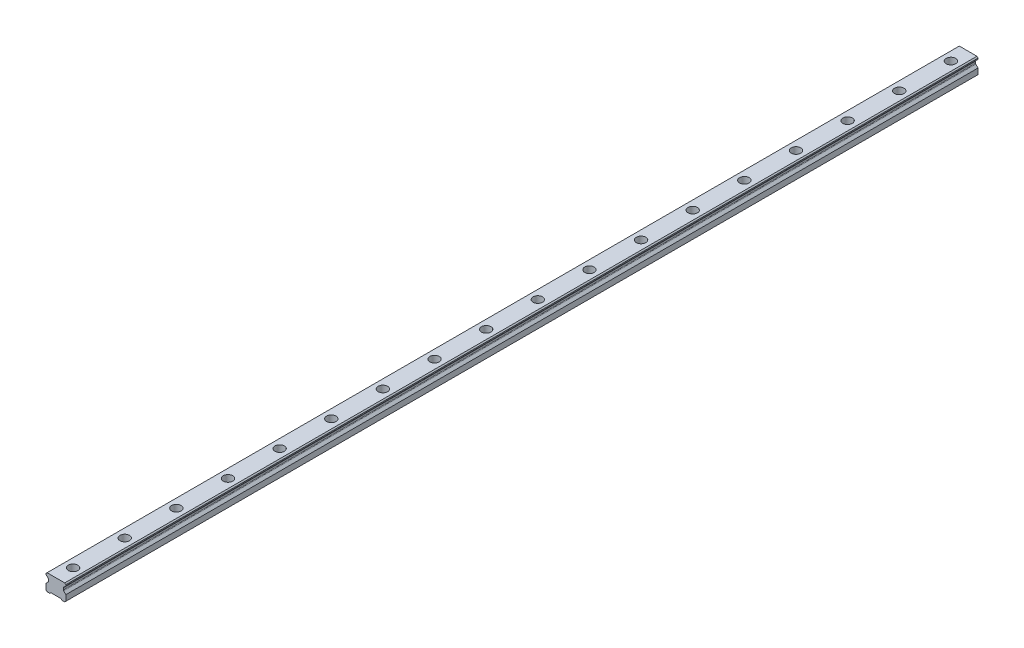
from build123d import *

# Parameters (mm, degrees)
SKETCH1_W           = 23
SKETCH1_H           = 19.2
BOSS_EXTRUDE1_DEPTH = 530
CUT_EXTRUDE1_DEPTH  = 1061.236242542
CHAMFER1_SIZE       = 1.25
FILLET1_R           = 1.25
CUT_EXTRUDE2_DEPTH  = 1061.236242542
SKETCH4_R           = 5.5
SKETCH4_R_2         = 3.5
CUT_EXTRUDE3_DEPTH  = 9
SKETCH4_2_R         = 3.5
CUT_EXTRUDE4_DEPTH  = 531.472327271
LPATTERN1_COUNT     = 18
LPATTERN1_PITCH     = 60


with BuildPart() as part:
    # Sketch1 → Boss-Extrude1 (new, symmetric)
    with BuildSketch(Plane.XY):
        with Locations((0, 9.6)):
            Rectangle(SKETCH1_W, SKETCH1_H)
    extrude(amount=BOSS_EXTRUDE1_DEPTH, both=True)

    # Sketch2 → Cut-Extrude1 (cut, through all)
    with BuildSketch(Plane.XY.offset(530)):
        Polygon((-11.5, 16.7), (-11.5, 7.95), (-8.583333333, 10.866666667), (-8.583333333, 13.783333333), align=None)
        Polygon((8.583333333, 13.783333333), (11.5, 16.7), (11.5, 7.95), (8.583333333, 10.866666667), align=None)
    extrude(amount=-CUT_EXTRUDE1_DEPTH, mode=Mode.SUBTRACT)

    # Chamfer1
    chamfer1_edges = [part.edges().sort_by_distance(p)[0] for p in [
        (-11.5, 19.2, 0),
        (11.5, 19.2, 0),
        (11.5, 0, 0),
        (-11.5, 0, 0),
    ]]
    chamfer(chamfer1_edges, length=CHAMFER1_SIZE)

    # Fillet1
    fillet1_edges = [part.edges().sort_by_distance(p)[0] for p in [
        (-8.583333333, 13.783333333, 0),
        (-8.583333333, 10.866666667, 0),
        (8.583333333, 10.866666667, 0),
        (8.583333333, 13.783333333, 0),
    ]]
    fillet(fillet1_edges, radius=FILLET1_R)

    # Sketch3 → Cut-Extrude2 (cut, through all)
    with BuildSketch(Plane.XY.offset(530)):
        Polygon((-7, 0), (-5.75, 1.25), (5.75, 1.25), (7, 0), align=None)
    extrude(amount=-CUT_EXTRUDE2_DEPTH, mode=Mode.SUBTRACT)

    # Sketch4 → Cut-Extrude3 (cut)
    with BuildSketch(Plane(origin=(0, 19.2, 0), x_dir=(1, 0, 0), z_dir=(0, 1, 0))):
        with Locations(Location((0, -510, 0), (0, 0, 270))):
            Circle(SKETCH4_R)
        with Locations(Location((0, -510, 0), (0, 0, 270))):
            Circle(SKETCH4_R_2, mode=Mode.SUBTRACT)
    cut_extrude3 = extrude(amount=-CUT_EXTRUDE3_DEPTH, mode=Mode.SUBTRACT)

    # Sketch4_2 → Cut-Extrude4 (cut, through all)
    with BuildSketch(Plane(origin=(0, 19.2, 0), x_dir=(1, 0, 0), z_dir=(0, 1, 0))):
        with Locations(Location((0, -510, 0), (0, 0, 270))):
            Circle(SKETCH4_2_R)
    cut_extrude4 = extrude(amount=-CUT_EXTRUDE4_DEPTH, mode=Mode.SUBTRACT)

    # LPattern1: Cut-Extrude3, Cut-Extrude4 ×18
    with Locations(*[(0, 0, -i * LPATTERN1_PITCH) for i in range(1, LPATTERN1_COUNT)]):
        add(cut_extrude3, mode=Mode.SUBTRACT)
        add(cut_extrude4, mode=Mode.SUBTRACT)


solid = part.part
